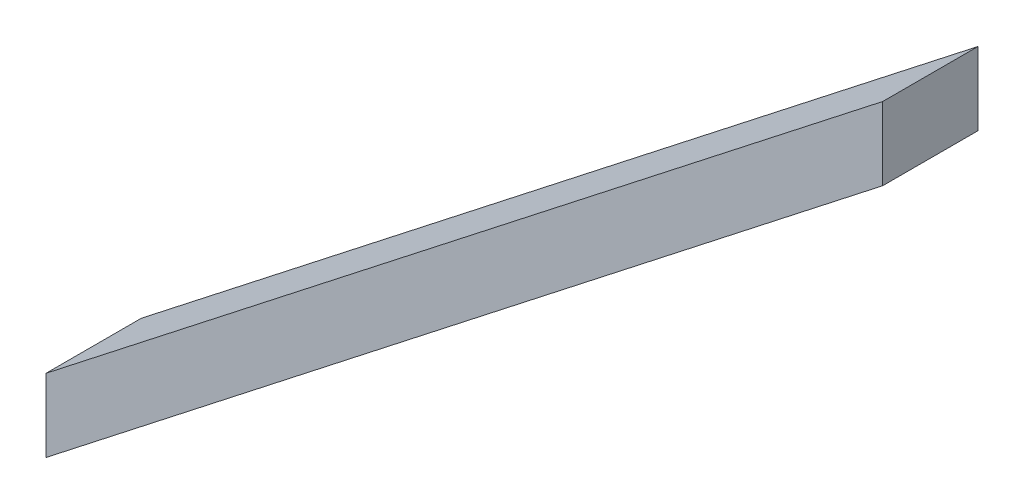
ISO-10303-21;
HEADER;
FILE_DESCRIPTION(('STEP AP214'),'2;1');
FILE_NAME('part.step','',(''),(''),'','','');
FILE_SCHEMA(('AUTOMOTIVE_DESIGN { 1 0 10303 214 1 1 1 1 }'));
ENDSEC;
DATA;
#1=APPLICATION_CONTEXT('core data for automotive mechanical design processes');
#2=APPLICATION_PROTOCOL_DEFINITION('international standard','automotive_design',2000,#1);
#3=PRODUCT_CONTEXT('',#1,'mechanical');
#4=PRODUCT('Part','Part','',(#3));
#5=PRODUCT_RELATED_PRODUCT_CATEGORY('part','',(#4));
#6=PRODUCT_DEFINITION_FORMATION('','',#4);
#7=PRODUCT_DEFINITION_CONTEXT('part definition',#1,'design');
#8=PRODUCT_DEFINITION('design','',#6,#7);
#9=PRODUCT_DEFINITION_SHAPE('','',#8);
#10=(LENGTH_UNIT() NAMED_UNIT(*) SI_UNIT(.MILLI.,.METRE.));
#11=(NAMED_UNIT(*) PLANE_ANGLE_UNIT() SI_UNIT($,.RADIAN.));
#12=(NAMED_UNIT(*) SI_UNIT($,.STERADIAN.) SOLID_ANGLE_UNIT());
#13=UNCERTAINTY_MEASURE_WITH_UNIT(LENGTH_MEASURE(1.E-05),#10,'distance_accuracy_value','');
#14=(GEOMETRIC_REPRESENTATION_CONTEXT(3) GLOBAL_UNCERTAINTY_ASSIGNED_CONTEXT((#13)) GLOBAL_UNIT_ASSIGNED_CONTEXT((#10,
#11,#12)) REPRESENTATION_CONTEXT('',''));
#15=CARTESIAN_POINT('',(0.,0.,0.));
#16=DIRECTION('',(0.,0.,1.));
#17=DIRECTION('',(1.,0.,0.));
#18=AXIS2_PLACEMENT_3D('',#15,#16,#17);
#19=CARTESIAN_POINT('',(0.,0.,63.));
#20=DIRECTION('',(-1.,0.,0.));
#21=DIRECTION('',(0.,0.,1.));
#22=AXIS2_PLACEMENT_3D('',#19,#20,#21);
#23=PLANE('',#22);
#24=DIRECTION('',(0.,1.,0.));
#25=VECTOR('',#24,1.);
#26=CARTESIAN_POINT('',(0.,0.,0.));
#27=LINE('',#26,#25);
#28=CARTESIAN_POINT('',(0.,0.,0.));
#29=VERTEX_POINT('',#28);
#30=CARTESIAN_POINT('',(0.,48.2226921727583,0.));
#31=VERTEX_POINT('',#30);
#32=EDGE_CURVE('E97',#29,#31,#27,.T.);
#33=ORIENTED_EDGE('',*,*,#32,.F.);
#34=DIRECTION('',(0.,0.,-1.));
#35=VECTOR('',#34,1.);
#36=CARTESIAN_POINT('',(0.,0.,63.));
#37=LINE('',#36,#35);
#38=CARTESIAN_POINT('',(0.,0.,63.));
#39=VERTEX_POINT('',#38);
#40=EDGE_CURVE('E11',#39,#29,#37,.T.);
#41=ORIENTED_EDGE('',*,*,#40,.F.);
#42=DIRECTION('',(0.,1.,0.));
#43=VECTOR('',#42,1.);
#44=CARTESIAN_POINT('',(0.,0.,63.));
#45=LINE('',#44,#43);
#46=CARTESIAN_POINT('',(0.,48.2226921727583,63.));
#47=VERTEX_POINT('',#46);
#48=EDGE_CURVE('E91',#39,#47,#45,.T.);
#49=ORIENTED_EDGE('',*,*,#48,.T.);
#50=DIRECTION('',(0.,0.,-1.));
#51=VECTOR('',#50,1.);
#52=CARTESIAN_POINT('',(0.,48.2226921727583,63.));
#53=LINE('',#52,#51);
#54=EDGE_CURVE('E36',#47,#31,#53,.T.);
#55=ORIENTED_EDGE('',*,*,#54,.T.);
#56=EDGE_LOOP('',(#33,#41,#49,#55));
#57=FACE_BOUND('',#56,.T.);
#58=ADVANCED_FACE('F33',(#57),#23,.T.);
#59=CARTESIAN_POINT('',(553.,432.050951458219,63.));
#60=DIRECTION('',(0.615661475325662,-0.788010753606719,0.));
#61=DIRECTION('',(0.788010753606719,0.615661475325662,0.));
#62=AXIS2_PLACEMENT_3D('',#59,#60,#61);
#63=PLANE('',#62);
#64=DIRECTION('',(-0.788010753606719,-0.615661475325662,0.));
#65=VECTOR('',#64,1.);
#66=CARTESIAN_POINT('',(553.,432.050951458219,0.));
#67=LINE('',#66,#65);
#68=CARTESIAN_POINT('',(553.,432.050951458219,0.));
#69=VERTEX_POINT('',#68);
#70=EDGE_CURVE('E93',#69,#29,#67,.T.);
#71=ORIENTED_EDGE('',*,*,#70,.F.);
#72=DIRECTION('',(0.,0.,-1.));
#73=VECTOR('',#72,1.);
#74=CARTESIAN_POINT('',(553.,432.050951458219,63.));
#75=LINE('',#74,#73);
#76=CARTESIAN_POINT('',(553.,432.050951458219,63.));
#77=VERTEX_POINT('',#76);
#78=EDGE_CURVE('E42',#77,#69,#75,.T.);
#79=ORIENTED_EDGE('',*,*,#78,.F.);
#80=DIRECTION('',(-0.788010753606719,-0.615661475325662,0.));
#81=VECTOR('',#80,1.);
#82=CARTESIAN_POINT('',(553.,432.050951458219,63.));
#83=LINE('',#82,#81);
#84=EDGE_CURVE('E88',#77,#39,#83,.T.);
#85=ORIENTED_EDGE('',*,*,#84,.T.);
#86=ORIENTED_EDGE('',*,*,#40,.T.);
#87=EDGE_LOOP('',(#71,#79,#85,#86));
#88=FACE_BOUND('',#87,.T.);
#89=ADVANCED_FACE('F107',(#88),#63,.T.);
#90=CARTESIAN_POINT('',(553.,480.273643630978,63.));
#91=DIRECTION('',(1.,0.,0.));
#92=DIRECTION('',(0.,1.,0.));
#93=AXIS2_PLACEMENT_3D('',#90,#91,#92);
#94=PLANE('',#93);
#95=DIRECTION('',(0.,-1.,0.));
#96=VECTOR('',#95,1.);
#97=CARTESIAN_POINT('',(553.,480.273643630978,0.));
#98=LINE('',#97,#96);
#99=CARTESIAN_POINT('',(553.,480.273643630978,0.));
#100=VERTEX_POINT('',#99);
#101=EDGE_CURVE('E83',#100,#69,#98,.T.);
#102=ORIENTED_EDGE('',*,*,#101,.F.);
#103=DIRECTION('',(0.,0.,-1.));
#104=VECTOR('',#103,1.);
#105=CARTESIAN_POINT('',(553.,480.273643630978,63.));
#106=LINE('',#105,#104);
#107=CARTESIAN_POINT('',(553.,480.273643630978,63.));
#108=VERTEX_POINT('',#107);
#109=EDGE_CURVE('E78',#108,#100,#106,.T.);
#110=ORIENTED_EDGE('',*,*,#109,.F.);
#111=DIRECTION('',(0.,-1.,0.));
#112=VECTOR('',#111,1.);
#113=CARTESIAN_POINT('',(553.,480.273643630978,63.));
#114=LINE('',#113,#112);
#115=EDGE_CURVE('E81',#108,#77,#114,.T.);
#116=ORIENTED_EDGE('',*,*,#115,.T.);
#117=ORIENTED_EDGE('',*,*,#78,.T.);
#118=EDGE_LOOP('',(#102,#110,#116,#117));
#119=FACE_BOUND('',#118,.T.);
#120=ADVANCED_FACE('F80',(#119),#94,.T.);
#121=CARTESIAN_POINT('',(0.,48.2226921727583,63.));
#122=DIRECTION('',(-0.615661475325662,0.788010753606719,0.));
#123=DIRECTION('',(-0.788010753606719,-0.615661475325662,0.));
#124=AXIS2_PLACEMENT_3D('',#121,#122,#123);
#125=PLANE('',#124);
#126=DIRECTION('',(0.788010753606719,0.615661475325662,0.));
#127=VECTOR('',#126,1.);
#128=CARTESIAN_POINT('',(0.,48.2226921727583,0.));
#129=LINE('',#128,#127);
#130=EDGE_CURVE('E100',#31,#100,#129,.T.);
#131=ORIENTED_EDGE('',*,*,#130,.F.);
#132=ORIENTED_EDGE('',*,*,#54,.F.);
#133=DIRECTION('',(0.788010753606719,0.615661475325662,0.));
#134=VECTOR('',#133,1.);
#135=CARTESIAN_POINT('',(0.,48.2226921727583,63.));
#136=LINE('',#135,#134);
#137=EDGE_CURVE('E87',#47,#108,#136,.T.);
#138=ORIENTED_EDGE('',*,*,#137,.T.);
#139=ORIENTED_EDGE('',*,*,#109,.T.);
#140=EDGE_LOOP('',(#131,#132,#138,#139));
#141=FACE_BOUND('',#140,.T.);
#142=ADVANCED_FACE('F90',(#141),#125,.T.);
#143=CARTESIAN_POINT('',(0.,0.,63.));
#144=DIRECTION('',(0.,0.,-1.));
#145=DIRECTION('',(-1.,0.,0.));
#146=AXIS2_PLACEMENT_3D('',#143,#144,#145);
#147=PLANE('',#146);
#148=ORIENTED_EDGE('',*,*,#48,.F.);
#149=ORIENTED_EDGE('',*,*,#84,.F.);
#150=ORIENTED_EDGE('',*,*,#115,.F.);
#151=ORIENTED_EDGE('',*,*,#137,.F.);
#152=EDGE_LOOP('',(#148,#149,#150,#151));
#153=FACE_BOUND('',#152,.T.);
#154=ADVANCED_FACE('F86',(#153),#147,.F.);
#155=CARTESIAN_POINT('',(0.,0.,0.));
#156=DIRECTION('',(0.,0.,-1.));
#157=DIRECTION('',(-1.,0.,0.));
#158=AXIS2_PLACEMENT_3D('',#155,#156,#157);
#159=PLANE('',#158);
#160=ORIENTED_EDGE('',*,*,#32,.T.);
#161=ORIENTED_EDGE('',*,*,#130,.T.);
#162=ORIENTED_EDGE('',*,*,#101,.T.);
#163=ORIENTED_EDGE('',*,*,#70,.T.);
#164=EDGE_LOOP('',(#160,#161,#162,#163));
#165=FACE_BOUND('',#164,.T.);
#166=ADVANCED_FACE('F106',(#165),#159,.T.);
#167=CLOSED_SHELL('',(#58,#89,#120,#142,#154,#166));
#168=MANIFOLD_SOLID_BREP('B2',#167);
#169=ADVANCED_BREP_SHAPE_REPRESENTATION('',(#18,#168),#14);
#170=SHAPE_DEFINITION_REPRESENTATION(#9,#169);
ENDSEC;
END-ISO-10303-21;
